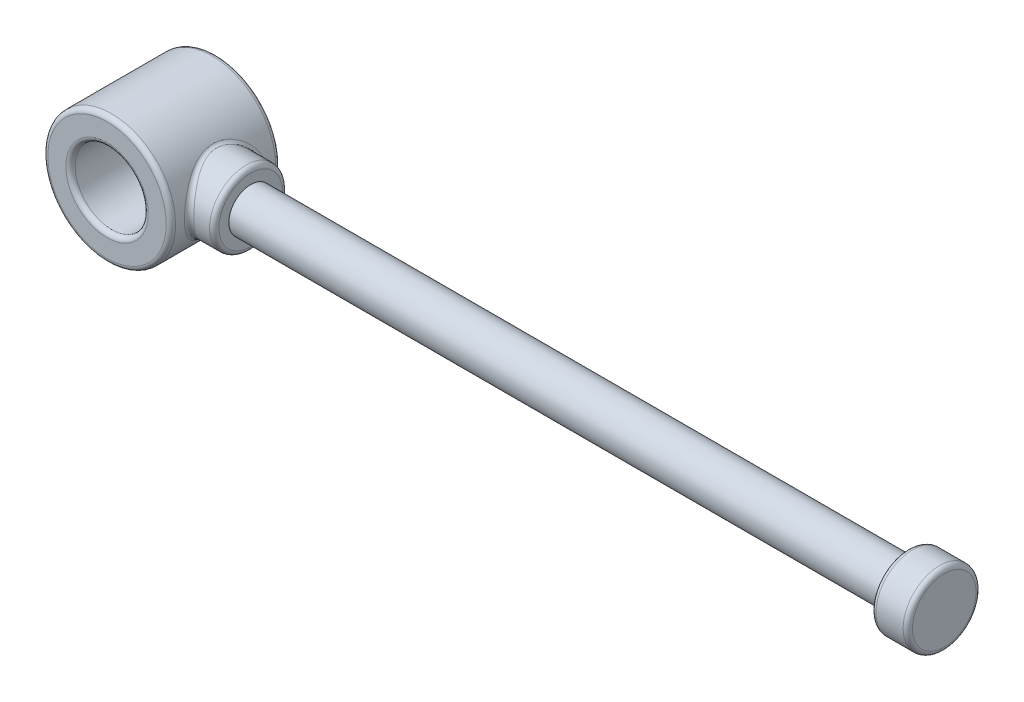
from build123d import *

# Parameters (mm, degrees)
SKETCH2_R           = 11.1125
SKETCH2_R_2         = 6.35
BOSS_EXTRUDE1_DEPTH = 9.525
FILLET1_R           = 0.8128


with BuildPart() as part:
    # Sketch1 → Revolve1 (revolve)
    with BuildSketch(Plane.XY, mode=Mode.PRIVATE) as revolve1_sk:
        Polygon((-127, 0), (0, 0), (0, 6.35), (-6.35, 6.35), (-6.35, 3.81), (-120.65, 3.81), (-120.65, 6.35), (-127, 6.35), align=None)
    revolve(revolve1_sk.sketch.rotate(Axis((-127, 0, 0), (1, 0, 0)), 90), axis=Axis((-127, 0, 0), (1, 0, 0)))

    # Sketch2 → Boss-Extrude1 (add, symmetric)
    with BuildSketch(Plane.XY):
        with Locations((-136.119493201, 0)):
            Circle(SKETCH2_R)
        with Locations(Location((-136.119493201, 0, 0), (0, 0, 180))):
            Circle(SKETCH2_R_2, mode=Mode.SUBTRACT)
    extrude(amount=BOSS_EXTRUDE1_DEPTH, both=True)

    # Fillet1
    fillet1_edges = [part.edges().sort_by_distance(p)[0] for p in [
        (-147.231993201, 0, -9.525),
        (-127, -6.35, 0),
        (-147.231993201, 0, 9.525),
        (-129.769493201, 0, -9.525),
        (-129.769493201, 0, 9.525),
        (-120.65, 0, -6.35),
        (-6.35, 0, -6.35),
        (0, 0, -6.35),
    ]]
    fillet(fillet1_edges, radius=FILLET1_R)


solid = part.part
